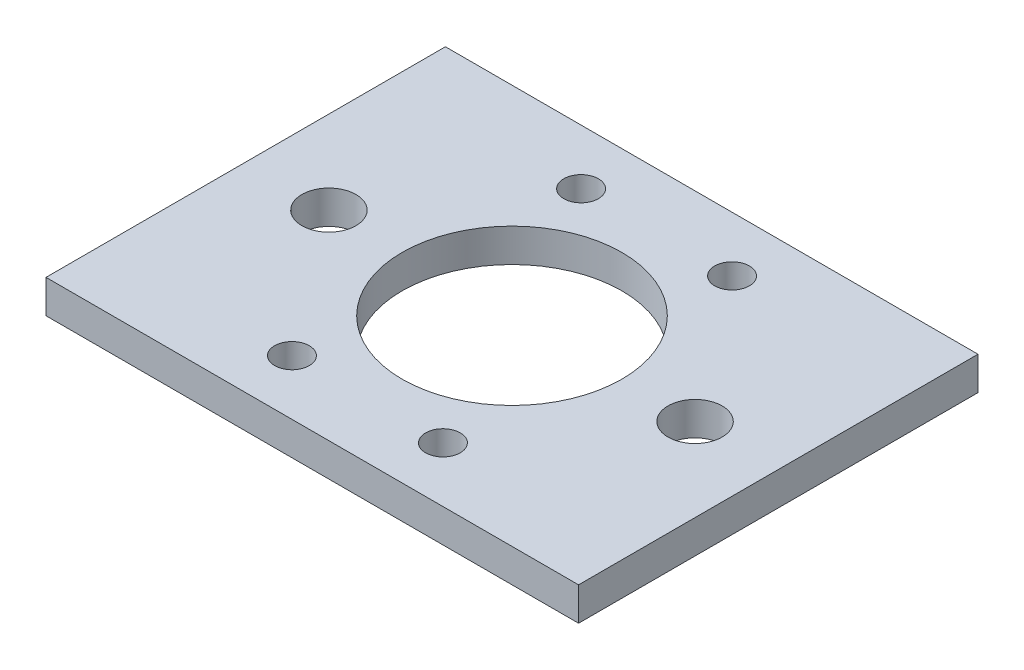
ISO-10303-21;
HEADER;
FILE_DESCRIPTION(('STEP AP214'),'2;1');
FILE_NAME('part.step','',(''),(''),'','','');
FILE_SCHEMA(('AUTOMOTIVE_DESIGN { 1 0 10303 214 1 1 1 1 }'));
ENDSEC;
DATA;
#1=APPLICATION_CONTEXT('core data for automotive mechanical design processes');
#2=APPLICATION_PROTOCOL_DEFINITION('international standard','automotive_design',2000,#1);
#3=PRODUCT_CONTEXT('',#1,'mechanical');
#4=PRODUCT('Part','Part','',(#3));
#5=PRODUCT_RELATED_PRODUCT_CATEGORY('part','',(#4));
#6=PRODUCT_DEFINITION_FORMATION('','',#4);
#7=PRODUCT_DEFINITION_CONTEXT('part definition',#1,'design');
#8=PRODUCT_DEFINITION('design','',#6,#7);
#9=PRODUCT_DEFINITION_SHAPE('','',#8);
#10=(LENGTH_UNIT() NAMED_UNIT(*) SI_UNIT(.MILLI.,.METRE.));
#11=(NAMED_UNIT(*) PLANE_ANGLE_UNIT() SI_UNIT($,.RADIAN.));
#12=(NAMED_UNIT(*) SI_UNIT($,.STERADIAN.) SOLID_ANGLE_UNIT());
#13=UNCERTAINTY_MEASURE_WITH_UNIT(LENGTH_MEASURE(1.E-05),#10,'distance_accuracy_value','');
#14=(GEOMETRIC_REPRESENTATION_CONTEXT(3) GLOBAL_UNCERTAINTY_ASSIGNED_CONTEXT((#13)) GLOBAL_UNIT_ASSIGNED_CONTEXT((#10,
#11,#12)) REPRESENTATION_CONTEXT('',''));
#15=CARTESIAN_POINT('',(0.,0.,0.));
#16=DIRECTION('',(0.,0.,1.));
#17=DIRECTION('',(1.,0.,0.));
#18=AXIS2_PLACEMENT_3D('',#15,#16,#17);
#19=CARTESIAN_POINT('',(0.,12.7,0.));
#20=DIRECTION('',(-1.,0.,0.));
#21=DIRECTION('',(0.,0.,1.));
#22=AXIS2_PLACEMENT_3D('',#19,#20,#21);
#23=PLANE('',#22);
#24=DIRECTION('',(0.,0.,-1.));
#25=VECTOR('',#24,1.);
#26=CARTESIAN_POINT('',(0.,0.,0.));
#27=LINE('',#26,#25);
#28=CARTESIAN_POINT('',(0.,0.,152.4));
#29=VERTEX_POINT('',#28);
#30=CARTESIAN_POINT('',(0.,0.,0.));
#31=VERTEX_POINT('',#30);
#32=EDGE_CURVE('E94',#29,#31,#27,.T.);
#33=ORIENTED_EDGE('',*,*,#32,.T.);
#34=DIRECTION('',(0.,-1.,0.));
#35=VECTOR('',#34,1.);
#36=CARTESIAN_POINT('',(0.,12.7,0.));
#37=LINE('',#36,#35);
#38=CARTESIAN_POINT('',(0.,12.7,0.));
#39=VERTEX_POINT('',#38);
#40=EDGE_CURVE('E11',#39,#31,#37,.T.);
#41=ORIENTED_EDGE('',*,*,#40,.F.);
#42=DIRECTION('',(0.,0.,-1.));
#43=VECTOR('',#42,1.);
#44=CARTESIAN_POINT('',(0.,12.7,0.));
#45=LINE('',#44,#43);
#46=CARTESIAN_POINT('',(0.,12.7,152.4));
#47=VERTEX_POINT('',#46);
#48=EDGE_CURVE('E82',#47,#39,#45,.T.);
#49=ORIENTED_EDGE('',*,*,#48,.F.);
#50=DIRECTION('',(0.,-1.,0.));
#51=VECTOR('',#50,1.);
#52=CARTESIAN_POINT('',(0.,12.7,152.4));
#53=LINE('',#52,#51);
#54=EDGE_CURVE('E90',#47,#29,#53,.T.);
#55=ORIENTED_EDGE('',*,*,#54,.T.);
#56=EDGE_LOOP('',(#33,#41,#49,#55));
#57=FACE_BOUND('',#56,.T.);
#58=ADVANCED_FACE('F31',(#57),#23,.F.);
#59=CARTESIAN_POINT('',(0.,12.7,0.));
#60=DIRECTION('',(0.,0.,1.));
#61=DIRECTION('',(1.,0.,0.));
#62=AXIS2_PLACEMENT_3D('',#59,#60,#61);
#63=PLANE('',#62);
#64=DIRECTION('',(-1.,0.,0.));
#65=VECTOR('',#64,1.);
#66=CARTESIAN_POINT('',(0.,0.,0.));
#67=LINE('',#66,#65);
#68=CARTESIAN_POINT('',(-203.2,0.,0.));
#69=VERTEX_POINT('',#68);
#70=EDGE_CURVE('E86',#31,#69,#67,.T.);
#71=ORIENTED_EDGE('',*,*,#70,.T.);
#72=DIRECTION('',(0.,-1.,0.));
#73=VECTOR('',#72,1.);
#74=CARTESIAN_POINT('',(-203.2,12.7,0.));
#75=LINE('',#74,#73);
#76=CARTESIAN_POINT('',(-203.2,12.7,0.));
#77=VERTEX_POINT('',#76);
#78=EDGE_CURVE('E39',#77,#69,#75,.T.);
#79=ORIENTED_EDGE('',*,*,#78,.F.);
#80=DIRECTION('',(-1.,0.,0.));
#81=VECTOR('',#80,1.);
#82=CARTESIAN_POINT('',(0.,12.7,0.));
#83=LINE('',#82,#81);
#84=EDGE_CURVE('E77',#39,#77,#83,.T.);
#85=ORIENTED_EDGE('',*,*,#84,.F.);
#86=ORIENTED_EDGE('',*,*,#40,.T.);
#87=EDGE_LOOP('',(#71,#79,#85,#86));
#88=FACE_BOUND('',#87,.T.);
#89=ADVANCED_FACE('F85',(#88),#63,.F.);
#90=CARTESIAN_POINT('',(-203.2,12.7,0.));
#91=DIRECTION('',(1.,0.,0.));
#92=DIRECTION('',(0.,0.,-1.));
#93=AXIS2_PLACEMENT_3D('',#90,#91,#92);
#94=PLANE('',#93);
#95=DIRECTION('',(0.,0.,1.));
#96=VECTOR('',#95,1.);
#97=CARTESIAN_POINT('',(-203.2,0.,0.));
#98=LINE('',#97,#96);
#99=CARTESIAN_POINT('',(-203.2,0.,152.4));
#100=VERTEX_POINT('',#99);
#101=EDGE_CURVE('E64',#69,#100,#98,.T.);
#102=ORIENTED_EDGE('',*,*,#101,.T.);
#103=DIRECTION('',(0.,-1.,0.));
#104=VECTOR('',#103,1.);
#105=CARTESIAN_POINT('',(-203.2,12.7,152.4));
#106=LINE('',#105,#104);
#107=CARTESIAN_POINT('',(-203.2,12.7,152.4));
#108=VERTEX_POINT('',#107);
#109=EDGE_CURVE('E87',#108,#100,#106,.T.);
#110=ORIENTED_EDGE('',*,*,#109,.F.);
#111=DIRECTION('',(0.,0.,1.));
#112=VECTOR('',#111,1.);
#113=CARTESIAN_POINT('',(-203.2,12.7,0.));
#114=LINE('',#113,#112);
#115=EDGE_CURVE('E80',#77,#108,#114,.T.);
#116=ORIENTED_EDGE('',*,*,#115,.F.);
#117=ORIENTED_EDGE('',*,*,#78,.T.);
#118=EDGE_LOOP('',(#102,#110,#116,#117));
#119=FACE_BOUND('',#118,.T.);
#120=ADVANCED_FACE('F88',(#119),#94,.F.);
#121=CARTESIAN_POINT('',(0.,12.7,152.4));
#122=DIRECTION('',(0.,0.,-1.));
#123=DIRECTION('',(-1.,0.,0.));
#124=AXIS2_PLACEMENT_3D('',#121,#122,#123);
#125=PLANE('',#124);
#126=DIRECTION('',(1.,0.,0.));
#127=VECTOR('',#126,1.);
#128=CARTESIAN_POINT('',(0.,0.,152.4));
#129=LINE('',#128,#127);
#130=EDGE_CURVE('E70',#100,#29,#129,.T.);
#131=ORIENTED_EDGE('',*,*,#130,.T.);
#132=ORIENTED_EDGE('',*,*,#54,.F.);
#133=DIRECTION('',(1.,0.,0.));
#134=VECTOR('',#133,1.);
#135=CARTESIAN_POINT('',(0.,12.7,152.4));
#136=LINE('',#135,#134);
#137=EDGE_CURVE('E47',#108,#47,#136,.T.);
#138=ORIENTED_EDGE('',*,*,#137,.F.);
#139=ORIENTED_EDGE('',*,*,#109,.T.);
#140=EDGE_LOOP('',(#131,#132,#138,#139));
#141=FACE_BOUND('',#140,.T.);
#142=ADVANCED_FACE('F102',(#141),#125,.F.);
#143=CARTESIAN_POINT('',(0.,12.7,0.));
#144=DIRECTION('',(0.,-1.,0.));
#145=DIRECTION('',(0.,0.,-1.));
#146=AXIS2_PLACEMENT_3D('',#143,#144,#145);
#147=PLANE('',#146);
#148=CARTESIAN_POINT('',(-171.45,12.7,76.2));
#149=DIRECTION('',(0.,1.,0.));
#150=DIRECTION('',(0.,0.,1.));
#151=AXIS2_PLACEMENT_3D('',#148,#149,#150);
#152=CIRCLE('',#151,10.31875);
#153=CARTESIAN_POINT('',(-171.45,12.7,86.51875));
#154=VERTEX_POINT('',#153);
#155=EDGE_CURVE('E144',#154,#154,#152,.T.);
#156=ORIENTED_EDGE('',*,*,#155,.F.);
#157=EDGE_LOOP('',(#156));
#158=FACE_BOUND('',#157,.T.);
#159=CARTESIAN_POINT('',(-31.75,12.7,76.2));
#160=DIRECTION('',(0.,1.,0.));
#161=DIRECTION('',(0.,0.,1.));
#162=AXIS2_PLACEMENT_3D('',#159,#160,#161);
#163=CIRCLE('',#162,10.31875);
#164=CARTESIAN_POINT('',(-31.75,12.7,86.51875));
#165=VERTEX_POINT('',#164);
#166=EDGE_CURVE('E138',#165,#165,#163,.T.);
#167=ORIENTED_EDGE('',*,*,#166,.F.);
#168=EDGE_LOOP('',(#167));
#169=FACE_BOUND('',#168,.T.);
#170=CARTESIAN_POINT('',(-130.4036,12.7,131.3561));
#171=DIRECTION('',(0.,1.,0.));
#172=DIRECTION('',(0.,0.,1.));
#173=AXIS2_PLACEMENT_3D('',#170,#171,#172);
#174=CIRCLE('',#173,6.60399999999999);
#175=CARTESIAN_POINT('',(-130.4036,12.7,137.9601));
#176=VERTEX_POINT('',#175);
#177=EDGE_CURVE('E132',#176,#176,#174,.T.);
#178=ORIENTED_EDGE('',*,*,#177,.F.);
#179=EDGE_LOOP('',(#178));
#180=FACE_BOUND('',#179,.T.);
#181=CARTESIAN_POINT('',(-130.4036,12.7,21.0439));
#182=DIRECTION('',(0.,1.,0.));
#183=DIRECTION('',(0.,0.,1.));
#184=AXIS2_PLACEMENT_3D('',#181,#182,#183);
#185=CIRCLE('',#184,6.604);
#186=CARTESIAN_POINT('',(-130.4036,12.7,27.6479));
#187=VERTEX_POINT('',#186);
#188=EDGE_CURVE('E126',#187,#187,#185,.T.);
#189=ORIENTED_EDGE('',*,*,#188,.F.);
#190=EDGE_LOOP('',(#189));
#191=FACE_BOUND('',#190,.T.);
#192=CARTESIAN_POINT('',(-72.7964,12.7,131.3561));
#193=DIRECTION('',(0.,1.,0.));
#194=DIRECTION('',(0.,0.,1.));
#195=AXIS2_PLACEMENT_3D('',#192,#193,#194);
#196=CIRCLE('',#195,6.60399999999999);
#197=CARTESIAN_POINT('',(-72.7964,12.7,137.9601));
#198=VERTEX_POINT('',#197);
#199=EDGE_CURVE('E120',#198,#198,#196,.T.);
#200=ORIENTED_EDGE('',*,*,#199,.F.);
#201=EDGE_LOOP('',(#200));
#202=FACE_BOUND('',#201,.T.);
#203=CARTESIAN_POINT('',(-72.7964,12.7,21.0439));
#204=DIRECTION('',(0.,1.,0.));
#205=DIRECTION('',(0.,0.,1.));
#206=AXIS2_PLACEMENT_3D('',#203,#204,#205);
#207=CIRCLE('',#206,6.604);
#208=CARTESIAN_POINT('',(-72.7964,12.7,27.6479));
#209=VERTEX_POINT('',#208);
#210=EDGE_CURVE('E114',#209,#209,#207,.T.);
#211=ORIENTED_EDGE('',*,*,#210,.F.);
#212=EDGE_LOOP('',(#211));
#213=FACE_BOUND('',#212,.T.);
#214=CARTESIAN_POINT('',(-101.6,12.7,76.2));
#215=DIRECTION('',(0.,1.,0.));
#216=DIRECTION('',(0.,0.,1.));
#217=AXIS2_PLACEMENT_3D('',#214,#215,#216);
#218=CIRCLE('',#217,41.91);
#219=CARTESIAN_POINT('',(-101.6,12.7,118.11));
#220=VERTEX_POINT('',#219);
#221=EDGE_CURVE('E108',#220,#220,#218,.T.);
#222=ORIENTED_EDGE('',*,*,#221,.F.);
#223=EDGE_LOOP('',(#222));
#224=FACE_BOUND('',#223,.T.);
#225=ORIENTED_EDGE('',*,*,#48,.T.);
#226=ORIENTED_EDGE('',*,*,#84,.T.);
#227=ORIENTED_EDGE('',*,*,#115,.T.);
#228=ORIENTED_EDGE('',*,*,#137,.T.);
#229=EDGE_LOOP('',(#225,#226,#227,#228));
#230=FACE_BOUND('',#229,.T.);
#231=ADVANCED_FACE('F78',(#158,#169,#180,#191,#202,#213,#224,#230),#147,.F.);
#232=CARTESIAN_POINT('',(0.,0.,0.));
#233=DIRECTION('',(0.,-1.,0.));
#234=DIRECTION('',(0.,0.,-1.));
#235=AXIS2_PLACEMENT_3D('',#232,#233,#234);
#236=PLANE('',#235);
#237=CARTESIAN_POINT('',(-171.45,0.,76.2));
#238=DIRECTION('',(0.,1.,0.));
#239=DIRECTION('',(0.,0.,1.));
#240=AXIS2_PLACEMENT_3D('',#237,#238,#239);
#241=CIRCLE('',#240,10.31875);
#242=CARTESIAN_POINT('',(-171.45,0.,86.51875));
#243=VERTEX_POINT('',#242);
#244=EDGE_CURVE('E141',#243,#243,#241,.T.);
#245=ORIENTED_EDGE('',*,*,#244,.T.);
#246=EDGE_LOOP('',(#245));
#247=FACE_BOUND('',#246,.T.);
#248=CARTESIAN_POINT('',(-31.75,0.,76.2));
#249=DIRECTION('',(0.,1.,0.));
#250=DIRECTION('',(0.,0.,1.));
#251=AXIS2_PLACEMENT_3D('',#248,#249,#250);
#252=CIRCLE('',#251,10.31875);
#253=CARTESIAN_POINT('',(-31.75,0.,86.51875));
#254=VERTEX_POINT('',#253);
#255=EDGE_CURVE('E135',#254,#254,#252,.T.);
#256=ORIENTED_EDGE('',*,*,#255,.T.);
#257=EDGE_LOOP('',(#256));
#258=FACE_BOUND('',#257,.T.);
#259=CARTESIAN_POINT('',(-130.4036,0.,131.3561));
#260=DIRECTION('',(0.,1.,0.));
#261=DIRECTION('',(0.,0.,1.));
#262=AXIS2_PLACEMENT_3D('',#259,#260,#261);
#263=CIRCLE('',#262,6.60399999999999);
#264=CARTESIAN_POINT('',(-130.4036,0.,137.9601));
#265=VERTEX_POINT('',#264);
#266=EDGE_CURVE('E129',#265,#265,#263,.T.);
#267=ORIENTED_EDGE('',*,*,#266,.T.);
#268=EDGE_LOOP('',(#267));
#269=FACE_BOUND('',#268,.T.);
#270=CARTESIAN_POINT('',(-130.4036,0.,21.0439));
#271=DIRECTION('',(0.,1.,0.));
#272=DIRECTION('',(0.,0.,1.));
#273=AXIS2_PLACEMENT_3D('',#270,#271,#272);
#274=CIRCLE('',#273,6.604);
#275=CARTESIAN_POINT('',(-130.4036,0.,27.6479));
#276=VERTEX_POINT('',#275);
#277=EDGE_CURVE('E123',#276,#276,#274,.T.);
#278=ORIENTED_EDGE('',*,*,#277,.T.);
#279=EDGE_LOOP('',(#278));
#280=FACE_BOUND('',#279,.T.);
#281=CARTESIAN_POINT('',(-72.7964,0.,131.3561));
#282=DIRECTION('',(0.,1.,0.));
#283=DIRECTION('',(0.,0.,1.));
#284=AXIS2_PLACEMENT_3D('',#281,#282,#283);
#285=CIRCLE('',#284,6.60399999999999);
#286=CARTESIAN_POINT('',(-72.7964,0.,137.9601));
#287=VERTEX_POINT('',#286);
#288=EDGE_CURVE('E117',#287,#287,#285,.T.);
#289=ORIENTED_EDGE('',*,*,#288,.T.);
#290=EDGE_LOOP('',(#289));
#291=FACE_BOUND('',#290,.T.);
#292=CARTESIAN_POINT('',(-72.7964,0.,21.0439));
#293=DIRECTION('',(0.,1.,0.));
#294=DIRECTION('',(0.,0.,1.));
#295=AXIS2_PLACEMENT_3D('',#292,#293,#294);
#296=CIRCLE('',#295,6.604);
#297=CARTESIAN_POINT('',(-72.7964,0.,27.6479));
#298=VERTEX_POINT('',#297);
#299=EDGE_CURVE('E111',#298,#298,#296,.T.);
#300=ORIENTED_EDGE('',*,*,#299,.T.);
#301=EDGE_LOOP('',(#300));
#302=FACE_BOUND('',#301,.T.);
#303=CARTESIAN_POINT('',(-101.6,0.,76.2));
#304=DIRECTION('',(0.,1.,0.));
#305=DIRECTION('',(0.,0.,1.));
#306=AXIS2_PLACEMENT_3D('',#303,#304,#305);
#307=CIRCLE('',#306,41.91);
#308=CARTESIAN_POINT('',(-101.6,0.,118.11));
#309=VERTEX_POINT('',#308);
#310=EDGE_CURVE('E97',#309,#309,#307,.T.);
#311=ORIENTED_EDGE('',*,*,#310,.T.);
#312=EDGE_LOOP('',(#311));
#313=FACE_BOUND('',#312,.T.);
#314=ORIENTED_EDGE('',*,*,#32,.F.);
#315=ORIENTED_EDGE('',*,*,#130,.F.);
#316=ORIENTED_EDGE('',*,*,#101,.F.);
#317=ORIENTED_EDGE('',*,*,#70,.F.);
#318=EDGE_LOOP('',(#314,#315,#316,#317));
#319=FACE_BOUND('',#318,.T.);
#320=ADVANCED_FACE('F105',(#247,#258,#269,#280,#291,#302,#313,#319),#236,.T.);
#321=CARTESIAN_POINT('',(-101.6,0.,76.2));
#322=DIRECTION('',(0.,1.,0.));
#323=DIRECTION('',(0.,0.,1.));
#324=AXIS2_PLACEMENT_3D('',#321,#322,#323);
#325=CYLINDRICAL_SURFACE('',#324,41.91);
#326=CARTESIAN_POINT('',(-101.6,0.,118.11));
#327=CARTESIAN_POINT('',(-101.6,0.132291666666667,118.11));
#328=CARTESIAN_POINT('',(-101.6,0.264583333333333,118.11));
#329=CARTESIAN_POINT('',(-101.6,0.529166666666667,118.11));
#330=CARTESIAN_POINT('',(-101.6,0.661458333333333,118.11));
#331=CARTESIAN_POINT('',(-101.6,0.926041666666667,118.11));
#332=CARTESIAN_POINT('',(-101.6,1.05833333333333,118.11));
#333=CARTESIAN_POINT('',(-101.6,1.32291666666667,118.11));
#334=CARTESIAN_POINT('',(-101.6,1.45520833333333,118.11));
#335=CARTESIAN_POINT('',(-101.6,1.71979166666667,118.11));
#336=CARTESIAN_POINT('',(-101.6,1.85208333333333,118.11));
#337=CARTESIAN_POINT('',(-101.6,2.11666666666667,118.11));
#338=CARTESIAN_POINT('',(-101.6,2.24895833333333,118.11));
#339=CARTESIAN_POINT('',(-101.6,2.51354166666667,118.11));
#340=CARTESIAN_POINT('',(-101.6,2.64583333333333,118.11));
#341=CARTESIAN_POINT('',(-101.6,2.91041666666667,118.11));
#342=CARTESIAN_POINT('',(-101.6,3.04270833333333,118.11));
#343=CARTESIAN_POINT('',(-101.6,3.30729166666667,118.11));
#344=CARTESIAN_POINT('',(-101.6,3.43958333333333,118.11));
#345=CARTESIAN_POINT('',(-101.6,3.70416666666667,118.11));
#346=CARTESIAN_POINT('',(-101.6,3.83645833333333,118.11));
#347=CARTESIAN_POINT('',(-101.6,4.10104166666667,118.11));
#348=CARTESIAN_POINT('',(-101.6,4.23333333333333,118.11));
#349=CARTESIAN_POINT('',(-101.6,4.49791666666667,118.11));
#350=CARTESIAN_POINT('',(-101.6,4.63020833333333,118.11));
#351=CARTESIAN_POINT('',(-101.6,4.89479166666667,118.11));
#352=CARTESIAN_POINT('',(-101.6,5.02708333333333,118.11));
#353=CARTESIAN_POINT('',(-101.6,5.29166666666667,118.11));
#354=CARTESIAN_POINT('',(-101.6,5.42395833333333,118.11));
#355=CARTESIAN_POINT('',(-101.6,5.68854166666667,118.11));
#356=CARTESIAN_POINT('',(-101.6,5.82083333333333,118.11));
#357=CARTESIAN_POINT('',(-101.6,6.08541666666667,118.11));
#358=CARTESIAN_POINT('',(-101.6,6.21770833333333,118.11));
#359=CARTESIAN_POINT('',(-101.6,6.48229166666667,118.11));
#360=CARTESIAN_POINT('',(-101.6,6.61458333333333,118.11));
#361=CARTESIAN_POINT('',(-101.6,6.87916666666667,118.11));
#362=CARTESIAN_POINT('',(-101.6,7.01145833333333,118.11));
#363=CARTESIAN_POINT('',(-101.6,7.27604166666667,118.11));
#364=CARTESIAN_POINT('',(-101.6,7.40833333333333,118.11));
#365=CARTESIAN_POINT('',(-101.6,7.67291666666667,118.11));
#366=CARTESIAN_POINT('',(-101.6,7.80520833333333,118.11));
#367=CARTESIAN_POINT('',(-101.6,8.06979166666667,118.11));
#368=CARTESIAN_POINT('',(-101.6,8.20208333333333,118.11));
#369=CARTESIAN_POINT('',(-101.6,8.46666666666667,118.11));
#370=CARTESIAN_POINT('',(-101.6,8.59895833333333,118.11));
#371=CARTESIAN_POINT('',(-101.6,8.86354166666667,118.11));
#372=CARTESIAN_POINT('',(-101.6,8.99583333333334,118.11));
#373=CARTESIAN_POINT('',(-101.6,9.26041666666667,118.11));
#374=CARTESIAN_POINT('',(-101.6,9.39270833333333,118.11));
#375=CARTESIAN_POINT('',(-101.6,9.65729166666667,118.11));
#376=CARTESIAN_POINT('',(-101.6,9.78958333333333,118.11));
#377=CARTESIAN_POINT('',(-101.6,10.0541666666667,118.11));
#378=CARTESIAN_POINT('',(-101.6,10.1864583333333,118.11));
#379=CARTESIAN_POINT('',(-101.6,10.4510416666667,118.11));
#380=CARTESIAN_POINT('',(-101.6,10.5833333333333,118.11));
#381=CARTESIAN_POINT('',(-101.6,10.8479166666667,118.11));
#382=CARTESIAN_POINT('',(-101.6,10.9802083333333,118.11));
#383=CARTESIAN_POINT('',(-101.6,11.2447916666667,118.11));
#384=CARTESIAN_POINT('',(-101.6,11.3770833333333,118.11));
#385=CARTESIAN_POINT('',(-101.6,11.6416666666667,118.11));
#386=CARTESIAN_POINT('',(-101.6,11.7739583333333,118.11));
#387=CARTESIAN_POINT('',(-101.6,12.0385416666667,118.11));
#388=CARTESIAN_POINT('',(-101.6,12.1708333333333,118.11));
#389=CARTESIAN_POINT('',(-101.6,12.4354166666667,118.11));
#390=CARTESIAN_POINT('',(-101.6,12.5677083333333,118.11));
#391=CARTESIAN_POINT('',(-101.6,12.7,118.11));
#392=B_SPLINE_CURVE_WITH_KNOTS('',3,(#326,#327,#328,#329,#330,#331,#332,#333,#334,#335,#336,
#337,#338,#339,#340,#341,#342,#343,#344,#345,#346,#347,#348,#349,#350,#351,#352,#353,#354,#355,
#356,#357,#358,#359,#360,#361,#362,#363,#364,#365,#366,#367,#368,#369,#370,#371,#372,#373,#374,
#375,#376,#377,#378,#379,#380,#381,#382,#383,#384,#385,#386,#387,#388,#389,#390,#391),
.UNSPECIFIED.,.F.,.F.,(4,2,2,2,2,2,2,2,2,2,2,2,2,2,2,2,2,2,2,2,2,2,2,2,2,2,2,2,2,2,2,2,4),(0.,
0.396875,0.79375,1.190625,1.5875,1.984375,2.38125,2.778125,3.175,3.571875,3.96875,4.365625,
4.7625,5.159375,5.55625,5.953125,6.35,6.746875,7.14375,7.540625,7.9375,8.334375,8.73125,
9.128125,9.525,9.921875,10.31875,10.715625,11.1125,11.509375,11.90625,12.303125,12.7),.UNSPECIFIED.);
#393=EDGE_CURVE('BSEAM174',#309,#220,#392,.T.);
#394=ORIENTED_EDGE('',*,*,#310,.F.);
#395=ORIENTED_EDGE('',*,*,#221,.T.);
#396=ORIENTED_EDGE('',*,*,#393,.T.);
#397=ORIENTED_EDGE('',*,*,#393,.F.);
#398=EDGE_LOOP('',(#394,#396,#395,#397));
#399=FACE_BOUND('',#398,.T.);
#400=ADVANCED_FACE('F174',(#399),#325,.F.);
#401=CARTESIAN_POINT('',(-72.7964,0.,21.0439));
#402=DIRECTION('',(0.,1.,0.));
#403=DIRECTION('',(0.,0.,1.));
#404=AXIS2_PLACEMENT_3D('',#401,#402,#403);
#405=CYLINDRICAL_SURFACE('',#404,6.604);
#406=CARTESIAN_POINT('',(-72.7964,0.,27.6479));
#407=CARTESIAN_POINT('',(-72.7964,0.132291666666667,27.6479));
#408=CARTESIAN_POINT('',(-72.7964,0.264583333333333,27.6479));
#409=CARTESIAN_POINT('',(-72.7964,0.529166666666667,27.6479));
#410=CARTESIAN_POINT('',(-72.7964,0.661458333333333,27.6479));
#411=CARTESIAN_POINT('',(-72.7964,0.926041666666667,27.6479));
#412=CARTESIAN_POINT('',(-72.7964,1.05833333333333,27.6479));
#413=CARTESIAN_POINT('',(-72.7964,1.32291666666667,27.6479));
#414=CARTESIAN_POINT('',(-72.7964,1.45520833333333,27.6479));
#415=CARTESIAN_POINT('',(-72.7964,1.71979166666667,27.6479));
#416=CARTESIAN_POINT('',(-72.7964,1.85208333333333,27.6479));
#417=CARTESIAN_POINT('',(-72.7964,2.11666666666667,27.6479));
#418=CARTESIAN_POINT('',(-72.7964,2.24895833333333,27.6479));
#419=CARTESIAN_POINT('',(-72.7964,2.51354166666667,27.6479));
#420=CARTESIAN_POINT('',(-72.7964,2.64583333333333,27.6479));
#421=CARTESIAN_POINT('',(-72.7964,2.91041666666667,27.6479));
#422=CARTESIAN_POINT('',(-72.7964,3.04270833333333,27.6479));
#423=CARTESIAN_POINT('',(-72.7964,3.30729166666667,27.6479));
#424=CARTESIAN_POINT('',(-72.7964,3.43958333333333,27.6479));
#425=CARTESIAN_POINT('',(-72.7964,3.70416666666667,27.6479));
#426=CARTESIAN_POINT('',(-72.7964,3.83645833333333,27.6479));
#427=CARTESIAN_POINT('',(-72.7964,4.10104166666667,27.6479));
#428=CARTESIAN_POINT('',(-72.7964,4.23333333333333,27.6479));
#429=CARTESIAN_POINT('',(-72.7964,4.49791666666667,27.6479));
#430=CARTESIAN_POINT('',(-72.7964,4.63020833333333,27.6479));
#431=CARTESIAN_POINT('',(-72.7964,4.89479166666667,27.6479));
#432=CARTESIAN_POINT('',(-72.7964,5.02708333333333,27.6479));
#433=CARTESIAN_POINT('',(-72.7964,5.29166666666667,27.6479));
#434=CARTESIAN_POINT('',(-72.7964,5.42395833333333,27.6479));
#435=CARTESIAN_POINT('',(-72.7964,5.68854166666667,27.6479));
#436=CARTESIAN_POINT('',(-72.7964,5.82083333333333,27.6479));
#437=CARTESIAN_POINT('',(-72.7964,6.08541666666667,27.6479));
#438=CARTESIAN_POINT('',(-72.7964,6.21770833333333,27.6479));
#439=CARTESIAN_POINT('',(-72.7964,6.48229166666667,27.6479));
#440=CARTESIAN_POINT('',(-72.7964,6.61458333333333,27.6479));
#441=CARTESIAN_POINT('',(-72.7964,6.87916666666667,27.6479));
#442=CARTESIAN_POINT('',(-72.7964,7.01145833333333,27.6479));
#443=CARTESIAN_POINT('',(-72.7964,7.27604166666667,27.6479));
#444=CARTESIAN_POINT('',(-72.7964,7.40833333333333,27.6479));
#445=CARTESIAN_POINT('',(-72.7964,7.67291666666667,27.6479));
#446=CARTESIAN_POINT('',(-72.7964,7.80520833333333,27.6479));
#447=CARTESIAN_POINT('',(-72.7964,8.06979166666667,27.6479));
#448=CARTESIAN_POINT('',(-72.7964,8.20208333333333,27.6479));
#449=CARTESIAN_POINT('',(-72.7964,8.46666666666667,27.6479));
#450=CARTESIAN_POINT('',(-72.7964,8.59895833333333,27.6479));
#451=CARTESIAN_POINT('',(-72.7964,8.86354166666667,27.6479));
#452=CARTESIAN_POINT('',(-72.7964,8.99583333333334,27.6479));
#453=CARTESIAN_POINT('',(-72.7964,9.26041666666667,27.6479));
#454=CARTESIAN_POINT('',(-72.7964,9.39270833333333,27.6479));
#455=CARTESIAN_POINT('',(-72.7964,9.65729166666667,27.6479));
#456=CARTESIAN_POINT('',(-72.7964,9.78958333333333,27.6479));
#457=CARTESIAN_POINT('',(-72.7964,10.0541666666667,27.6479));
#458=CARTESIAN_POINT('',(-72.7964,10.1864583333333,27.6479));
#459=CARTESIAN_POINT('',(-72.7964,10.4510416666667,27.6479));
#460=CARTESIAN_POINT('',(-72.7964,10.5833333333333,27.6479));
#461=CARTESIAN_POINT('',(-72.7964,10.8479166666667,27.6479));
#462=CARTESIAN_POINT('',(-72.7964,10.9802083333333,27.6479));
#463=CARTESIAN_POINT('',(-72.7964,11.2447916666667,27.6479));
#464=CARTESIAN_POINT('',(-72.7964,11.3770833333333,27.6479));
#465=CARTESIAN_POINT('',(-72.7964,11.6416666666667,27.6479));
#466=CARTESIAN_POINT('',(-72.7964,11.7739583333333,27.6479));
#467=CARTESIAN_POINT('',(-72.7964,12.0385416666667,27.6479));
#468=CARTESIAN_POINT('',(-72.7964,12.1708333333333,27.6479));
#469=CARTESIAN_POINT('',(-72.7964,12.4354166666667,27.6479));
#470=CARTESIAN_POINT('',(-72.7964,12.5677083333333,27.6479));
#471=CARTESIAN_POINT('',(-72.7964,12.7,27.6479));
#472=B_SPLINE_CURVE_WITH_KNOTS('',3,(#406,#407,#408,#409,#410,#411,#412,#413,#414,#415,#416,
#417,#418,#419,#420,#421,#422,#423,#424,#425,#426,#427,#428,#429,#430,#431,#432,#433,#434,#435,
#436,#437,#438,#439,#440,#441,#442,#443,#444,#445,#446,#447,#448,#449,#450,#451,#452,#453,#454,
#455,#456,#457,#458,#459,#460,#461,#462,#463,#464,#465,#466,#467,#468,#469,#470,#471),
.UNSPECIFIED.,.F.,.F.,(4,2,2,2,2,2,2,2,2,2,2,2,2,2,2,2,2,2,2,2,2,2,2,2,2,2,2,2,2,2,2,2,4),(0.,
0.396875,0.79375,1.190625,1.5875,1.984375,2.38125,2.778125,3.175,3.571875,3.96875,4.365625,
4.7625,5.159375,5.55625,5.953125,6.35,6.746875,7.14375,7.540625,7.9375,8.334375,8.73125,
9.128125,9.525,9.921875,10.31875,10.715625,11.1125,11.509375,11.90625,12.303125,12.7),.UNSPECIFIED.);
#473=EDGE_CURVE('BSEAM176',#298,#209,#472,.T.);
#474=ORIENTED_EDGE('',*,*,#299,.F.);
#475=ORIENTED_EDGE('',*,*,#210,.T.);
#476=ORIENTED_EDGE('',*,*,#473,.T.);
#477=ORIENTED_EDGE('',*,*,#473,.F.);
#478=EDGE_LOOP('',(#474,#476,#475,#477));
#479=FACE_BOUND('',#478,.T.);
#480=ADVANCED_FACE('F176',(#479),#405,.F.);
#481=CARTESIAN_POINT('',(-72.7964,0.,131.3561));
#482=DIRECTION('',(0.,1.,0.));
#483=DIRECTION('',(0.,0.,1.));
#484=AXIS2_PLACEMENT_3D('',#481,#482,#483);
#485=CYLINDRICAL_SURFACE('',#484,6.60399999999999);
#486=CARTESIAN_POINT('',(-72.7964,0.,137.9601));
#487=CARTESIAN_POINT('',(-72.7964,0.132291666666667,137.9601));
#488=CARTESIAN_POINT('',(-72.7964,0.264583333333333,137.9601));
#489=CARTESIAN_POINT('',(-72.7964,0.529166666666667,137.9601));
#490=CARTESIAN_POINT('',(-72.7964,0.661458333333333,137.9601));
#491=CARTESIAN_POINT('',(-72.7964,0.926041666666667,137.9601));
#492=CARTESIAN_POINT('',(-72.7964,1.05833333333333,137.9601));
#493=CARTESIAN_POINT('',(-72.7964,1.32291666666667,137.9601));
#494=CARTESIAN_POINT('',(-72.7964,1.45520833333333,137.9601));
#495=CARTESIAN_POINT('',(-72.7964,1.71979166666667,137.9601));
#496=CARTESIAN_POINT('',(-72.7964,1.85208333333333,137.9601));
#497=CARTESIAN_POINT('',(-72.7964,2.11666666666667,137.9601));
#498=CARTESIAN_POINT('',(-72.7964,2.24895833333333,137.9601));
#499=CARTESIAN_POINT('',(-72.7964,2.51354166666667,137.9601));
#500=CARTESIAN_POINT('',(-72.7964,2.64583333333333,137.9601));
#501=CARTESIAN_POINT('',(-72.7964,2.91041666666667,137.9601));
#502=CARTESIAN_POINT('',(-72.7964,3.04270833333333,137.9601));
#503=CARTESIAN_POINT('',(-72.7964,3.30729166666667,137.9601));
#504=CARTESIAN_POINT('',(-72.7964,3.43958333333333,137.9601));
#505=CARTESIAN_POINT('',(-72.7964,3.70416666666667,137.9601));
#506=CARTESIAN_POINT('',(-72.7964,3.83645833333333,137.9601));
#507=CARTESIAN_POINT('',(-72.7964,4.10104166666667,137.9601));
#508=CARTESIAN_POINT('',(-72.7964,4.23333333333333,137.9601));
#509=CARTESIAN_POINT('',(-72.7964,4.49791666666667,137.9601));
#510=CARTESIAN_POINT('',(-72.7964,4.63020833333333,137.9601));
#511=CARTESIAN_POINT('',(-72.7964,4.89479166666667,137.9601));
#512=CARTESIAN_POINT('',(-72.7964,5.02708333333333,137.9601));
#513=CARTESIAN_POINT('',(-72.7964,5.29166666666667,137.9601));
#514=CARTESIAN_POINT('',(-72.7964,5.42395833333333,137.9601));
#515=CARTESIAN_POINT('',(-72.7964,5.68854166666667,137.9601));
#516=CARTESIAN_POINT('',(-72.7964,5.82083333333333,137.9601));
#517=CARTESIAN_POINT('',(-72.7964,6.08541666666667,137.9601));
#518=CARTESIAN_POINT('',(-72.7964,6.21770833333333,137.9601));
#519=CARTESIAN_POINT('',(-72.7964,6.48229166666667,137.9601));
#520=CARTESIAN_POINT('',(-72.7964,6.61458333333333,137.9601));
#521=CARTESIAN_POINT('',(-72.7964,6.87916666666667,137.9601));
#522=CARTESIAN_POINT('',(-72.7964,7.01145833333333,137.9601));
#523=CARTESIAN_POINT('',(-72.7964,7.27604166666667,137.9601));
#524=CARTESIAN_POINT('',(-72.7964,7.40833333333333,137.9601));
#525=CARTESIAN_POINT('',(-72.7964,7.67291666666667,137.9601));
#526=CARTESIAN_POINT('',(-72.7964,7.80520833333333,137.9601));
#527=CARTESIAN_POINT('',(-72.7964,8.06979166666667,137.9601));
#528=CARTESIAN_POINT('',(-72.7964,8.20208333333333,137.9601));
#529=CARTESIAN_POINT('',(-72.7964,8.46666666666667,137.9601));
#530=CARTESIAN_POINT('',(-72.7964,8.59895833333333,137.9601));
#531=CARTESIAN_POINT('',(-72.7964,8.86354166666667,137.9601));
#532=CARTESIAN_POINT('',(-72.7964,8.99583333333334,137.9601));
#533=CARTESIAN_POINT('',(-72.7964,9.26041666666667,137.9601));
#534=CARTESIAN_POINT('',(-72.7964,9.39270833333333,137.9601));
#535=CARTESIAN_POINT('',(-72.7964,9.65729166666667,137.9601));
#536=CARTESIAN_POINT('',(-72.7964,9.78958333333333,137.9601));
#537=CARTESIAN_POINT('',(-72.7964,10.0541666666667,137.9601));
#538=CARTESIAN_POINT('',(-72.7964,10.1864583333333,137.9601));
#539=CARTESIAN_POINT('',(-72.7964,10.4510416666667,137.9601));
#540=CARTESIAN_POINT('',(-72.7964,10.5833333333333,137.9601));
#541=CARTESIAN_POINT('',(-72.7964,10.8479166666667,137.9601));
#542=CARTESIAN_POINT('',(-72.7964,10.9802083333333,137.9601));
#543=CARTESIAN_POINT('',(-72.7964,11.2447916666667,137.9601));
#544=CARTESIAN_POINT('',(-72.7964,11.3770833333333,137.9601));
#545=CARTESIAN_POINT('',(-72.7964,11.6416666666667,137.9601));
#546=CARTESIAN_POINT('',(-72.7964,11.7739583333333,137.9601));
#547=CARTESIAN_POINT('',(-72.7964,12.0385416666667,137.9601));
#548=CARTESIAN_POINT('',(-72.7964,12.1708333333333,137.9601));
#549=CARTESIAN_POINT('',(-72.7964,12.4354166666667,137.9601));
#550=CARTESIAN_POINT('',(-72.7964,12.5677083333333,137.9601));
#551=CARTESIAN_POINT('',(-72.7964,12.7,137.9601));
#552=B_SPLINE_CURVE_WITH_KNOTS('',3,(#486,#487,#488,#489,#490,#491,#492,#493,#494,#495,#496,
#497,#498,#499,#500,#501,#502,#503,#504,#505,#506,#507,#508,#509,#510,#511,#512,#513,#514,#515,
#516,#517,#518,#519,#520,#521,#522,#523,#524,#525,#526,#527,#528,#529,#530,#531,#532,#533,#534,
#535,#536,#537,#538,#539,#540,#541,#542,#543,#544,#545,#546,#547,#548,#549,#550,#551),
.UNSPECIFIED.,.F.,.F.,(4,2,2,2,2,2,2,2,2,2,2,2,2,2,2,2,2,2,2,2,2,2,2,2,2,2,2,2,2,2,2,2,4),(0.,
0.396875,0.79375,1.190625,1.5875,1.984375,2.38125,2.778125,3.175,3.571875,3.96875,4.365625,
4.7625,5.159375,5.55625,5.953125,6.35,6.746875,7.14375,7.540625,7.9375,8.334375,8.73125,
9.128125,9.525,9.921875,10.31875,10.715625,11.1125,11.509375,11.90625,12.303125,12.7),.UNSPECIFIED.);
#553=EDGE_CURVE('BSEAM183',#287,#198,#552,.T.);
#554=ORIENTED_EDGE('',*,*,#288,.F.);
#555=ORIENTED_EDGE('',*,*,#199,.T.);
#556=ORIENTED_EDGE('',*,*,#553,.T.);
#557=ORIENTED_EDGE('',*,*,#553,.F.);
#558=EDGE_LOOP('',(#554,#556,#555,#557));
#559=FACE_BOUND('',#558,.T.);
#560=ADVANCED_FACE('F183',(#559),#485,.F.);
#561=CARTESIAN_POINT('',(-130.4036,0.,21.0439));
#562=DIRECTION('',(0.,1.,0.));
#563=DIRECTION('',(0.,0.,1.));
#564=AXIS2_PLACEMENT_3D('',#561,#562,#563);
#565=CYLINDRICAL_SURFACE('',#564,6.604);
#566=CARTESIAN_POINT('',(-130.4036,0.,27.6479));
#567=CARTESIAN_POINT('',(-130.4036,0.132291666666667,27.6479));
#568=CARTESIAN_POINT('',(-130.4036,0.264583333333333,27.6479));
#569=CARTESIAN_POINT('',(-130.4036,0.529166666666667,27.6479));
#570=CARTESIAN_POINT('',(-130.4036,0.661458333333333,27.6479));
#571=CARTESIAN_POINT('',(-130.4036,0.926041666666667,27.6479));
#572=CARTESIAN_POINT('',(-130.4036,1.05833333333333,27.6479));
#573=CARTESIAN_POINT('',(-130.4036,1.32291666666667,27.6479));
#574=CARTESIAN_POINT('',(-130.4036,1.45520833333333,27.6479));
#575=CARTESIAN_POINT('',(-130.4036,1.71979166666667,27.6479));
#576=CARTESIAN_POINT('',(-130.4036,1.85208333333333,27.6479));
#577=CARTESIAN_POINT('',(-130.4036,2.11666666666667,27.6479));
#578=CARTESIAN_POINT('',(-130.4036,2.24895833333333,27.6479));
#579=CARTESIAN_POINT('',(-130.4036,2.51354166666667,27.6479));
#580=CARTESIAN_POINT('',(-130.4036,2.64583333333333,27.6479));
#581=CARTESIAN_POINT('',(-130.4036,2.91041666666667,27.6479));
#582=CARTESIAN_POINT('',(-130.4036,3.04270833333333,27.6479));
#583=CARTESIAN_POINT('',(-130.4036,3.30729166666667,27.6479));
#584=CARTESIAN_POINT('',(-130.4036,3.43958333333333,27.6479));
#585=CARTESIAN_POINT('',(-130.4036,3.70416666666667,27.6479));
#586=CARTESIAN_POINT('',(-130.4036,3.83645833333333,27.6479));
#587=CARTESIAN_POINT('',(-130.4036,4.10104166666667,27.6479));
#588=CARTESIAN_POINT('',(-130.4036,4.23333333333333,27.6479));
#589=CARTESIAN_POINT('',(-130.4036,4.49791666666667,27.6479));
#590=CARTESIAN_POINT('',(-130.4036,4.63020833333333,27.6479));
#591=CARTESIAN_POINT('',(-130.4036,4.89479166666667,27.6479));
#592=CARTESIAN_POINT('',(-130.4036,5.02708333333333,27.6479));
#593=CARTESIAN_POINT('',(-130.4036,5.29166666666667,27.6479));
#594=CARTESIAN_POINT('',(-130.4036,5.42395833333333,27.6479));
#595=CARTESIAN_POINT('',(-130.4036,5.68854166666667,27.6479));
#596=CARTESIAN_POINT('',(-130.4036,5.82083333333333,27.6479));
#597=CARTESIAN_POINT('',(-130.4036,6.08541666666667,27.6479));
#598=CARTESIAN_POINT('',(-130.4036,6.21770833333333,27.6479));
#599=CARTESIAN_POINT('',(-130.4036,6.48229166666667,27.6479));
#600=CARTESIAN_POINT('',(-130.4036,6.61458333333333,27.6479));
#601=CARTESIAN_POINT('',(-130.4036,6.87916666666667,27.6479));
#602=CARTESIAN_POINT('',(-130.4036,7.01145833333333,27.6479));
#603=CARTESIAN_POINT('',(-130.4036,7.27604166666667,27.6479));
#604=CARTESIAN_POINT('',(-130.4036,7.40833333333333,27.6479));
#605=CARTESIAN_POINT('',(-130.4036,7.67291666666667,27.6479));
#606=CARTESIAN_POINT('',(-130.4036,7.80520833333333,27.6479));
#607=CARTESIAN_POINT('',(-130.4036,8.06979166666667,27.6479));
#608=CARTESIAN_POINT('',(-130.4036,8.20208333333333,27.6479));
#609=CARTESIAN_POINT('',(-130.4036,8.46666666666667,27.6479));
#610=CARTESIAN_POINT('',(-130.4036,8.59895833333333,27.6479));
#611=CARTESIAN_POINT('',(-130.4036,8.86354166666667,27.6479));
#612=CARTESIAN_POINT('',(-130.4036,8.99583333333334,27.6479));
#613=CARTESIAN_POINT('',(-130.4036,9.26041666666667,27.6479));
#614=CARTESIAN_POINT('',(-130.4036,9.39270833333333,27.6479));
#615=CARTESIAN_POINT('',(-130.4036,9.65729166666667,27.6479));
#616=CARTESIAN_POINT('',(-130.4036,9.78958333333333,27.6479));
#617=CARTESIAN_POINT('',(-130.4036,10.0541666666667,27.6479));
#618=CARTESIAN_POINT('',(-130.4036,10.1864583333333,27.6479));
#619=CARTESIAN_POINT('',(-130.4036,10.4510416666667,27.6479));
#620=CARTESIAN_POINT('',(-130.4036,10.5833333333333,27.6479));
#621=CARTESIAN_POINT('',(-130.4036,10.8479166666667,27.6479));
#622=CARTESIAN_POINT('',(-130.4036,10.9802083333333,27.6479));
#623=CARTESIAN_POINT('',(-130.4036,11.2447916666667,27.6479));
#624=CARTESIAN_POINT('',(-130.4036,11.3770833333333,27.6479));
#625=CARTESIAN_POINT('',(-130.4036,11.6416666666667,27.6479));
#626=CARTESIAN_POINT('',(-130.4036,11.7739583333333,27.6479));
#627=CARTESIAN_POINT('',(-130.4036,12.0385416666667,27.6479));
#628=CARTESIAN_POINT('',(-130.4036,12.1708333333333,27.6479));
#629=CARTESIAN_POINT('',(-130.4036,12.4354166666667,27.6479));
#630=CARTESIAN_POINT('',(-130.4036,12.5677083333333,27.6479));
#631=CARTESIAN_POINT('',(-130.4036,12.7,27.6479));
#632=B_SPLINE_CURVE_WITH_KNOTS('',3,(#566,#567,#568,#569,#570,#571,#572,#573,#574,#575,#576,
#577,#578,#579,#580,#581,#582,#583,#584,#585,#586,#587,#588,#589,#590,#591,#592,#593,#594,#595,
#596,#597,#598,#599,#600,#601,#602,#603,#604,#605,#606,#607,#608,#609,#610,#611,#612,#613,#614,
#615,#616,#617,#618,#619,#620,#621,#622,#623,#624,#625,#626,#627,#628,#629,#630,#631),
.UNSPECIFIED.,.F.,.F.,(4,2,2,2,2,2,2,2,2,2,2,2,2,2,2,2,2,2,2,2,2,2,2,2,2,2,2,2,2,2,2,2,4),(0.,
0.396875,0.79375,1.190625,1.5875,1.984375,2.38125,2.778125,3.175,3.571875,3.96875,4.365625,
4.7625,5.159375,5.55625,5.953125,6.35,6.746875,7.14375,7.540625,7.9375,8.334375,8.73125,
9.128125,9.525,9.921875,10.31875,10.715625,11.1125,11.509375,11.90625,12.303125,12.7),.UNSPECIFIED.);
#633=EDGE_CURVE('BSEAM236',#276,#187,#632,.T.);
#634=ORIENTED_EDGE('',*,*,#277,.F.);
#635=ORIENTED_EDGE('',*,*,#188,.T.);
#636=ORIENTED_EDGE('',*,*,#633,.T.);
#637=ORIENTED_EDGE('',*,*,#633,.F.);
#638=EDGE_LOOP('',(#634,#636,#635,#637));
#639=FACE_BOUND('',#638,.T.);
#640=ADVANCED_FACE('F236',(#639),#565,.F.);
#641=CARTESIAN_POINT('',(-130.4036,0.,131.3561));
#642=DIRECTION('',(0.,1.,0.));
#643=DIRECTION('',(0.,0.,1.));
#644=AXIS2_PLACEMENT_3D('',#641,#642,#643);
#645=CYLINDRICAL_SURFACE('',#644,6.60399999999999);
#646=CARTESIAN_POINT('',(-130.4036,0.,137.9601));
#647=CARTESIAN_POINT('',(-130.4036,0.132291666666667,137.9601));
#648=CARTESIAN_POINT('',(-130.4036,0.264583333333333,137.9601));
#649=CARTESIAN_POINT('',(-130.4036,0.529166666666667,137.9601));
#650=CARTESIAN_POINT('',(-130.4036,0.661458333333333,137.9601));
#651=CARTESIAN_POINT('',(-130.4036,0.926041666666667,137.9601));
#652=CARTESIAN_POINT('',(-130.4036,1.05833333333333,137.9601));
#653=CARTESIAN_POINT('',(-130.4036,1.32291666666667,137.9601));
#654=CARTESIAN_POINT('',(-130.4036,1.45520833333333,137.9601));
#655=CARTESIAN_POINT('',(-130.4036,1.71979166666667,137.9601));
#656=CARTESIAN_POINT('',(-130.4036,1.85208333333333,137.9601));
#657=CARTESIAN_POINT('',(-130.4036,2.11666666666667,137.9601));
#658=CARTESIAN_POINT('',(-130.4036,2.24895833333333,137.9601));
#659=CARTESIAN_POINT('',(-130.4036,2.51354166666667,137.9601));
#660=CARTESIAN_POINT('',(-130.4036,2.64583333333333,137.9601));
#661=CARTESIAN_POINT('',(-130.4036,2.91041666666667,137.9601));
#662=CARTESIAN_POINT('',(-130.4036,3.04270833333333,137.9601));
#663=CARTESIAN_POINT('',(-130.4036,3.30729166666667,137.9601));
#664=CARTESIAN_POINT('',(-130.4036,3.43958333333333,137.9601));
#665=CARTESIAN_POINT('',(-130.4036,3.70416666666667,137.9601));
#666=CARTESIAN_POINT('',(-130.4036,3.83645833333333,137.9601));
#667=CARTESIAN_POINT('',(-130.4036,4.10104166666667,137.9601));
#668=CARTESIAN_POINT('',(-130.4036,4.23333333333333,137.9601));
#669=CARTESIAN_POINT('',(-130.4036,4.49791666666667,137.9601));
#670=CARTESIAN_POINT('',(-130.4036,4.63020833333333,137.9601));
#671=CARTESIAN_POINT('',(-130.4036,4.89479166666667,137.9601));
#672=CARTESIAN_POINT('',(-130.4036,5.02708333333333,137.9601));
#673=CARTESIAN_POINT('',(-130.4036,5.29166666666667,137.9601));
#674=CARTESIAN_POINT('',(-130.4036,5.42395833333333,137.9601));
#675=CARTESIAN_POINT('',(-130.4036,5.68854166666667,137.9601));
#676=CARTESIAN_POINT('',(-130.4036,5.82083333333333,137.9601));
#677=CARTESIAN_POINT('',(-130.4036,6.08541666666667,137.9601));
#678=CARTESIAN_POINT('',(-130.4036,6.21770833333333,137.9601));
#679=CARTESIAN_POINT('',(-130.4036,6.48229166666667,137.9601));
#680=CARTESIAN_POINT('',(-130.4036,6.61458333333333,137.9601));
#681=CARTESIAN_POINT('',(-130.4036,6.87916666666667,137.9601));
#682=CARTESIAN_POINT('',(-130.4036,7.01145833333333,137.9601));
#683=CARTESIAN_POINT('',(-130.4036,7.27604166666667,137.9601));
#684=CARTESIAN_POINT('',(-130.4036,7.40833333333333,137.9601));
#685=CARTESIAN_POINT('',(-130.4036,7.67291666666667,137.9601));
#686=CARTESIAN_POINT('',(-130.4036,7.80520833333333,137.9601));
#687=CARTESIAN_POINT('',(-130.4036,8.06979166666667,137.9601));
#688=CARTESIAN_POINT('',(-130.4036,8.20208333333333,137.9601));
#689=CARTESIAN_POINT('',(-130.4036,8.46666666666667,137.9601));
#690=CARTESIAN_POINT('',(-130.4036,8.59895833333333,137.9601));
#691=CARTESIAN_POINT('',(-130.4036,8.86354166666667,137.9601));
#692=CARTESIAN_POINT('',(-130.4036,8.99583333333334,137.9601));
#693=CARTESIAN_POINT('',(-130.4036,9.26041666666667,137.9601));
#694=CARTESIAN_POINT('',(-130.4036,9.39270833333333,137.9601));
#695=CARTESIAN_POINT('',(-130.4036,9.65729166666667,137.9601));
#696=CARTESIAN_POINT('',(-130.4036,9.78958333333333,137.9601));
#697=CARTESIAN_POINT('',(-130.4036,10.0541666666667,137.9601));
#698=CARTESIAN_POINT('',(-130.4036,10.1864583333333,137.9601));
#699=CARTESIAN_POINT('',(-130.4036,10.4510416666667,137.9601));
#700=CARTESIAN_POINT('',(-130.4036,10.5833333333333,137.9601));
#701=CARTESIAN_POINT('',(-130.4036,10.8479166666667,137.9601));
#702=CARTESIAN_POINT('',(-130.4036,10.9802083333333,137.9601));
#703=CARTESIAN_POINT('',(-130.4036,11.2447916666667,137.9601));
#704=CARTESIAN_POINT('',(-130.4036,11.3770833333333,137.9601));
#705=CARTESIAN_POINT('',(-130.4036,11.6416666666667,137.9601));
#706=CARTESIAN_POINT('',(-130.4036,11.7739583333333,137.9601));
#707=CARTESIAN_POINT('',(-130.4036,12.0385416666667,137.9601));
#708=CARTESIAN_POINT('',(-130.4036,12.1708333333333,137.9601));
#709=CARTESIAN_POINT('',(-130.4036,12.4354166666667,137.9601));
#710=CARTESIAN_POINT('',(-130.4036,12.5677083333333,137.9601));
#711=CARTESIAN_POINT('',(-130.4036,12.7,137.9601));
#712=B_SPLINE_CURVE_WITH_KNOTS('',3,(#646,#647,#648,#649,#650,#651,#652,#653,#654,#655,#656,
#657,#658,#659,#660,#661,#662,#663,#664,#665,#666,#667,#668,#669,#670,#671,#672,#673,#674,#675,
#676,#677,#678,#679,#680,#681,#682,#683,#684,#685,#686,#687,#688,#689,#690,#691,#692,#693,#694,
#695,#696,#697,#698,#699,#700,#701,#702,#703,#704,#705,#706,#707,#708,#709,#710,#711),
.UNSPECIFIED.,.F.,.F.,(4,2,2,2,2,2,2,2,2,2,2,2,2,2,2,2,2,2,2,2,2,2,2,2,2,2,2,2,2,2,2,2,4),(0.,
0.396875,0.79375,1.190625,1.5875,1.984375,2.38125,2.778125,3.175,3.571875,3.96875,4.365625,
4.7625,5.159375,5.55625,5.953125,6.35,6.746875,7.14375,7.540625,7.9375,8.334375,8.73125,
9.128125,9.525,9.921875,10.31875,10.715625,11.1125,11.509375,11.90625,12.303125,12.7),.UNSPECIFIED.);
#713=EDGE_CURVE('BSEAM221',#265,#176,#712,.T.);
#714=ORIENTED_EDGE('',*,*,#266,.F.);
#715=ORIENTED_EDGE('',*,*,#177,.T.);
#716=ORIENTED_EDGE('',*,*,#713,.T.);
#717=ORIENTED_EDGE('',*,*,#713,.F.);
#718=EDGE_LOOP('',(#714,#716,#715,#717));
#719=FACE_BOUND('',#718,.T.);
#720=ADVANCED_FACE('F221',(#719),#645,.F.);
#721=CARTESIAN_POINT('',(-31.75,0.,76.2));
#722=DIRECTION('',(0.,1.,0.));
#723=DIRECTION('',(0.,0.,1.));
#724=AXIS2_PLACEMENT_3D('',#721,#722,#723);
#725=CYLINDRICAL_SURFACE('',#724,10.31875);
#726=CARTESIAN_POINT('',(-31.75,0.,86.51875));
#727=CARTESIAN_POINT('',(-31.75,0.132291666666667,86.51875));
#728=CARTESIAN_POINT('',(-31.75,0.264583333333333,86.51875));
#729=CARTESIAN_POINT('',(-31.75,0.529166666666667,86.51875));
#730=CARTESIAN_POINT('',(-31.75,0.661458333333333,86.51875));
#731=CARTESIAN_POINT('',(-31.75,0.926041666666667,86.51875));
#732=CARTESIAN_POINT('',(-31.75,1.05833333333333,86.51875));
#733=CARTESIAN_POINT('',(-31.75,1.32291666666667,86.51875));
#734=CARTESIAN_POINT('',(-31.75,1.45520833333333,86.51875));
#735=CARTESIAN_POINT('',(-31.75,1.71979166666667,86.51875));
#736=CARTESIAN_POINT('',(-31.75,1.85208333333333,86.51875));
#737=CARTESIAN_POINT('',(-31.75,2.11666666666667,86.51875));
#738=CARTESIAN_POINT('',(-31.75,2.24895833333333,86.51875));
#739=CARTESIAN_POINT('',(-31.75,2.51354166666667,86.51875));
#740=CARTESIAN_POINT('',(-31.75,2.64583333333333,86.51875));
#741=CARTESIAN_POINT('',(-31.75,2.91041666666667,86.51875));
#742=CARTESIAN_POINT('',(-31.75,3.04270833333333,86.51875));
#743=CARTESIAN_POINT('',(-31.75,3.30729166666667,86.51875));
#744=CARTESIAN_POINT('',(-31.75,3.43958333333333,86.51875));
#745=CARTESIAN_POINT('',(-31.75,3.70416666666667,86.51875));
#746=CARTESIAN_POINT('',(-31.75,3.83645833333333,86.51875));
#747=CARTESIAN_POINT('',(-31.75,4.10104166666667,86.51875));
#748=CARTESIAN_POINT('',(-31.75,4.23333333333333,86.51875));
#749=CARTESIAN_POINT('',(-31.75,4.49791666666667,86.51875));
#750=CARTESIAN_POINT('',(-31.75,4.63020833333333,86.51875));
#751=CARTESIAN_POINT('',(-31.75,4.89479166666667,86.51875));
#752=CARTESIAN_POINT('',(-31.75,5.02708333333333,86.51875));
#753=CARTESIAN_POINT('',(-31.75,5.29166666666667,86.51875));
#754=CARTESIAN_POINT('',(-31.75,5.42395833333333,86.51875));
#755=CARTESIAN_POINT('',(-31.75,5.68854166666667,86.51875));
#756=CARTESIAN_POINT('',(-31.75,5.82083333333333,86.51875));
#757=CARTESIAN_POINT('',(-31.75,6.08541666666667,86.51875));
#758=CARTESIAN_POINT('',(-31.75,6.21770833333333,86.51875));
#759=CARTESIAN_POINT('',(-31.75,6.48229166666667,86.51875));
#760=CARTESIAN_POINT('',(-31.75,6.61458333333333,86.51875));
#761=CARTESIAN_POINT('',(-31.75,6.87916666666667,86.51875));
#762=CARTESIAN_POINT('',(-31.75,7.01145833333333,86.51875));
#763=CARTESIAN_POINT('',(-31.75,7.27604166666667,86.51875));
#764=CARTESIAN_POINT('',(-31.75,7.40833333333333,86.51875));
#765=CARTESIAN_POINT('',(-31.75,7.67291666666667,86.51875));
#766=CARTESIAN_POINT('',(-31.75,7.80520833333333,86.51875));
#767=CARTESIAN_POINT('',(-31.75,8.06979166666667,86.51875));
#768=CARTESIAN_POINT('',(-31.75,8.20208333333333,86.51875));
#769=CARTESIAN_POINT('',(-31.75,8.46666666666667,86.51875));
#770=CARTESIAN_POINT('',(-31.75,8.59895833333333,86.51875));
#771=CARTESIAN_POINT('',(-31.75,8.86354166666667,86.51875));
#772=CARTESIAN_POINT('',(-31.75,8.99583333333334,86.51875));
#773=CARTESIAN_POINT('',(-31.75,9.26041666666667,86.51875));
#774=CARTESIAN_POINT('',(-31.75,9.39270833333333,86.51875));
#775=CARTESIAN_POINT('',(-31.75,9.65729166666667,86.51875));
#776=CARTESIAN_POINT('',(-31.75,9.78958333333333,86.51875));
#777=CARTESIAN_POINT('',(-31.75,10.0541666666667,86.51875));
#778=CARTESIAN_POINT('',(-31.75,10.1864583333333,86.51875));
#779=CARTESIAN_POINT('',(-31.75,10.4510416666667,86.51875));
#780=CARTESIAN_POINT('',(-31.75,10.5833333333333,86.51875));
#781=CARTESIAN_POINT('',(-31.75,10.8479166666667,86.51875));
#782=CARTESIAN_POINT('',(-31.75,10.9802083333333,86.51875));
#783=CARTESIAN_POINT('',(-31.75,11.2447916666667,86.51875));
#784=CARTESIAN_POINT('',(-31.75,11.3770833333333,86.51875));
#785=CARTESIAN_POINT('',(-31.75,11.6416666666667,86.51875));
#786=CARTESIAN_POINT('',(-31.75,11.7739583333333,86.51875));
#787=CARTESIAN_POINT('',(-31.75,12.0385416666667,86.51875));
#788=CARTESIAN_POINT('',(-31.75,12.1708333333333,86.51875));
#789=CARTESIAN_POINT('',(-31.75,12.4354166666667,86.51875));
#790=CARTESIAN_POINT('',(-31.75,12.5677083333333,86.51875));
#791=CARTESIAN_POINT('',(-31.75,12.7,86.51875));
#792=B_SPLINE_CURVE_WITH_KNOTS('',3,(#726,#727,#728,#729,#730,#731,#732,#733,#734,#735,#736,
#737,#738,#739,#740,#741,#742,#743,#744,#745,#746,#747,#748,#749,#750,#751,#752,#753,#754,#755,
#756,#757,#758,#759,#760,#761,#762,#763,#764,#765,#766,#767,#768,#769,#770,#771,#772,#773,#774,
#775,#776,#777,#778,#779,#780,#781,#782,#783,#784,#785,#786,#787,#788,#789,#790,#791),
.UNSPECIFIED.,.F.,.F.,(4,2,2,2,2,2,2,2,2,2,2,2,2,2,2,2,2,2,2,2,2,2,2,2,2,2,2,2,2,2,2,2,4),(0.,
0.396875,0.79375,1.190625,1.5875,1.984375,2.38125,2.778125,3.175,3.571875,3.96875,4.365625,
4.7625,5.159375,5.55625,5.953125,6.35,6.746875,7.14375,7.540625,7.9375,8.334375,8.73125,
9.128125,9.525,9.921875,10.31875,10.715625,11.1125,11.509375,11.90625,12.303125,12.7),.UNSPECIFIED.);
#793=EDGE_CURVE('BSEAM155',#254,#165,#792,.T.);
#794=ORIENTED_EDGE('',*,*,#255,.F.);
#795=ORIENTED_EDGE('',*,*,#166,.T.);
#796=ORIENTED_EDGE('',*,*,#793,.T.);
#797=ORIENTED_EDGE('',*,*,#793,.F.);
#798=EDGE_LOOP('',(#794,#796,#795,#797));
#799=FACE_BOUND('',#798,.T.);
#800=ADVANCED_FACE('F155',(#799),#725,.F.);
#801=CARTESIAN_POINT('',(-171.45,0.,76.2));
#802=DIRECTION('',(0.,1.,0.));
#803=DIRECTION('',(0.,0.,1.));
#804=AXIS2_PLACEMENT_3D('',#801,#802,#803);
#805=CYLINDRICAL_SURFACE('',#804,10.31875);
#806=CARTESIAN_POINT('',(-171.45,0.,86.51875));
#807=CARTESIAN_POINT('',(-171.45,0.132291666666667,86.51875));
#808=CARTESIAN_POINT('',(-171.45,0.264583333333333,86.51875));
#809=CARTESIAN_POINT('',(-171.45,0.529166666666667,86.51875));
#810=CARTESIAN_POINT('',(-171.45,0.661458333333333,86.51875));
#811=CARTESIAN_POINT('',(-171.45,0.926041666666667,86.51875));
#812=CARTESIAN_POINT('',(-171.45,1.05833333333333,86.51875));
#813=CARTESIAN_POINT('',(-171.45,1.32291666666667,86.51875));
#814=CARTESIAN_POINT('',(-171.45,1.45520833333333,86.51875));
#815=CARTESIAN_POINT('',(-171.45,1.71979166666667,86.51875));
#816=CARTESIAN_POINT('',(-171.45,1.85208333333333,86.51875));
#817=CARTESIAN_POINT('',(-171.45,2.11666666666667,86.51875));
#818=CARTESIAN_POINT('',(-171.45,2.24895833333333,86.51875));
#819=CARTESIAN_POINT('',(-171.45,2.51354166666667,86.51875));
#820=CARTESIAN_POINT('',(-171.45,2.64583333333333,86.51875));
#821=CARTESIAN_POINT('',(-171.45,2.91041666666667,86.51875));
#822=CARTESIAN_POINT('',(-171.45,3.04270833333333,86.51875));
#823=CARTESIAN_POINT('',(-171.45,3.30729166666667,86.51875));
#824=CARTESIAN_POINT('',(-171.45,3.43958333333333,86.51875));
#825=CARTESIAN_POINT('',(-171.45,3.70416666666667,86.51875));
#826=CARTESIAN_POINT('',(-171.45,3.83645833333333,86.51875));
#827=CARTESIAN_POINT('',(-171.45,4.10104166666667,86.51875));
#828=CARTESIAN_POINT('',(-171.45,4.23333333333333,86.51875));
#829=CARTESIAN_POINT('',(-171.45,4.49791666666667,86.51875));
#830=CARTESIAN_POINT('',(-171.45,4.63020833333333,86.51875));
#831=CARTESIAN_POINT('',(-171.45,4.89479166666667,86.51875));
#832=CARTESIAN_POINT('',(-171.45,5.02708333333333,86.51875));
#833=CARTESIAN_POINT('',(-171.45,5.29166666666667,86.51875));
#834=CARTESIAN_POINT('',(-171.45,5.42395833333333,86.51875));
#835=CARTESIAN_POINT('',(-171.45,5.68854166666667,86.51875));
#836=CARTESIAN_POINT('',(-171.45,5.82083333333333,86.51875));
#837=CARTESIAN_POINT('',(-171.45,6.08541666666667,86.51875));
#838=CARTESIAN_POINT('',(-171.45,6.21770833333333,86.51875));
#839=CARTESIAN_POINT('',(-171.45,6.48229166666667,86.51875));
#840=CARTESIAN_POINT('',(-171.45,6.61458333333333,86.51875));
#841=CARTESIAN_POINT('',(-171.45,6.87916666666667,86.51875));
#842=CARTESIAN_POINT('',(-171.45,7.01145833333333,86.51875));
#843=CARTESIAN_POINT('',(-171.45,7.27604166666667,86.51875));
#844=CARTESIAN_POINT('',(-171.45,7.40833333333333,86.51875));
#845=CARTESIAN_POINT('',(-171.45,7.67291666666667,86.51875));
#846=CARTESIAN_POINT('',(-171.45,7.80520833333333,86.51875));
#847=CARTESIAN_POINT('',(-171.45,8.06979166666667,86.51875));
#848=CARTESIAN_POINT('',(-171.45,8.20208333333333,86.51875));
#849=CARTESIAN_POINT('',(-171.45,8.46666666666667,86.51875));
#850=CARTESIAN_POINT('',(-171.45,8.59895833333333,86.51875));
#851=CARTESIAN_POINT('',(-171.45,8.86354166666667,86.51875));
#852=CARTESIAN_POINT('',(-171.45,8.99583333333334,86.51875));
#853=CARTESIAN_POINT('',(-171.45,9.26041666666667,86.51875));
#854=CARTESIAN_POINT('',(-171.45,9.39270833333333,86.51875));
#855=CARTESIAN_POINT('',(-171.45,9.65729166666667,86.51875));
#856=CARTESIAN_POINT('',(-171.45,9.78958333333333,86.51875));
#857=CARTESIAN_POINT('',(-171.45,10.0541666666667,86.51875));
#858=CARTESIAN_POINT('',(-171.45,10.1864583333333,86.51875));
#859=CARTESIAN_POINT('',(-171.45,10.4510416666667,86.51875));
#860=CARTESIAN_POINT('',(-171.45,10.5833333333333,86.51875));
#861=CARTESIAN_POINT('',(-171.45,10.8479166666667,86.51875));
#862=CARTESIAN_POINT('',(-171.45,10.9802083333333,86.51875));
#863=CARTESIAN_POINT('',(-171.45,11.2447916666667,86.51875));
#864=CARTESIAN_POINT('',(-171.45,11.3770833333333,86.51875));
#865=CARTESIAN_POINT('',(-171.45,11.6416666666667,86.51875));
#866=CARTESIAN_POINT('',(-171.45,11.7739583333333,86.51875));
#867=CARTESIAN_POINT('',(-171.45,12.0385416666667,86.51875));
#868=CARTESIAN_POINT('',(-171.45,12.1708333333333,86.51875));
#869=CARTESIAN_POINT('',(-171.45,12.4354166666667,86.51875));
#870=CARTESIAN_POINT('',(-171.45,12.5677083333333,86.51875));
#871=CARTESIAN_POINT('',(-171.45,12.7,86.51875));
#872=B_SPLINE_CURVE_WITH_KNOTS('',3,(#806,#807,#808,#809,#810,#811,#812,#813,#814,#815,#816,
#817,#818,#819,#820,#821,#822,#823,#824,#825,#826,#827,#828,#829,#830,#831,#832,#833,#834,#835,
#836,#837,#838,#839,#840,#841,#842,#843,#844,#845,#846,#847,#848,#849,#850,#851,#852,#853,#854,
#855,#856,#857,#858,#859,#860,#861,#862,#863,#864,#865,#866,#867,#868,#869,#870,#871),
.UNSPECIFIED.,.F.,.F.,(4,2,2,2,2,2,2,2,2,2,2,2,2,2,2,2,2,2,2,2,2,2,2,2,2,2,2,2,2,2,2,2,4),(0.,
0.396875,0.79375,1.190625,1.5875,1.984375,2.38125,2.778125,3.175,3.571875,3.96875,4.365625,
4.7625,5.159375,5.55625,5.953125,6.35,6.746875,7.14375,7.540625,7.9375,8.334375,8.73125,
9.128125,9.525,9.921875,10.31875,10.715625,11.1125,11.509375,11.90625,12.303125,12.7),.UNSPECIFIED.);
#873=EDGE_CURVE('BSEAM152',#243,#154,#872,.T.);
#874=ORIENTED_EDGE('',*,*,#244,.F.);
#875=ORIENTED_EDGE('',*,*,#155,.T.);
#876=ORIENTED_EDGE('',*,*,#873,.T.);
#877=ORIENTED_EDGE('',*,*,#873,.F.);
#878=EDGE_LOOP('',(#874,#876,#875,#877));
#879=FACE_BOUND('',#878,.T.);
#880=ADVANCED_FACE('F152',(#879),#805,.F.);
#881=CLOSED_SHELL('',(#58,#89,#120,#142,#231,#320,#400,#480,#560,#640,#720,#800,#880));
#882=MANIFOLD_SOLID_BREP('B2',#881);
#883=ADVANCED_BREP_SHAPE_REPRESENTATION('',(#18,#882),#14);
#884=SHAPE_DEFINITION_REPRESENTATION(#9,#883);
ENDSEC;
END-ISO-10303-21;
